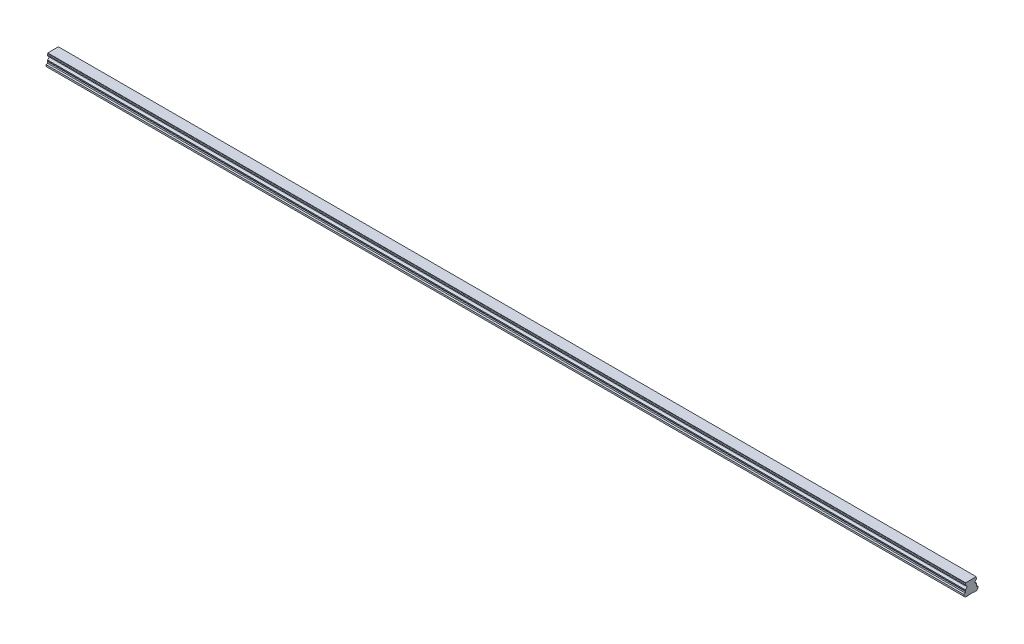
from build123d import *

# Parameters (mm, degrees)
BOSS_EXTRUDE1_DEPTH        = 1620
SKETCH3_R                  = 3
SKETCH3_R_2                = 2.5
CUT_EXTRUDE3_DEPTH         = 12
SKETCH3_2_R                = 2.5
CUT_EXTRUDE4_DEPTH         = 15
CHAMFER1_SIZE              = 0.5
LPATTERN4_COUNT            = 27
LPATTERN4_PITCH            = 60
CHAMFER1_OF_LPATTERN4_SIZE = 0.5


with BuildPart() as part:
    # Sketch1 → Boss-Extrude1 (new body)
    with BuildSketch(Plane(origin=(0, 0, 0), x_dir=(0, 0, -1), z_dir=(1, 0, 0))):
        with BuildLine():
            Line((9.375, 21.8), (-9.375, 21.8))
            Line((-9.375, 21.8), (-9.375, 20.756))
            Line((-9.375, 20.756), (-10, 19.415683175))
            Line((-10, 19.415683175), (-10, 17.685449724))
            ThreePointArc((-10, 17.685449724), (-7.2, 14.6), (-10, 11.514550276))
            Line((-10, 11.514550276), (-10, 9.784316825))
            Line((-10, 9.784316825), (-9.375, 8.444))
            Line((-9.375, 8.444), (-9.922688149, 6.4))
            Line((-9.922688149, 6.4), (-12.5, 5.489338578))
            Line((-12.5, 5.489338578), (-12.5, 2.65))
            Line((-12.5, 2.65), (-9.85, 0))
            Line((-9.85, 0), (-5.5, 0))
            Line((-5.5, 0), (-5, 0.5))
            Line((-5, 0.5), (5, 0.5))
            Line((5, 0.5), (5.5, 0))
            Line((5.5, 0), (9.85, 0))
            Line((9.85, 0), (12.5, 2.65))
            Line((12.5, 2.65), (12.5, 5.489338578))
            Line((12.5, 5.489338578), (9.922688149, 6.4))
            Line((9.922688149, 6.4), (9.375, 8.444))
            Line((9.375, 8.444), (10, 9.784316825))
            Line((10, 9.784316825), (10, 11.514550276))
            ThreePointArc((10, 11.514550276), (7.2, 14.6), (10, 17.685449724))
            Line((10, 17.685449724), (10, 19.415683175))
            Line((10, 19.415683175), (9.375, 20.756))
            Line((9.375, 20.756), (9.375, 21.8))
        make_face()
    extrude(amount=BOSS_EXTRUDE1_DEPTH)

    # Sketch3 → Cut-Extrude3 (cut)
    with BuildSketch(Plane.XZ):
        with Locations(Location((30, 0, 0), (0, 0, 270))):
            Circle(SKETCH3_R)
        with Locations(Location((30, 0, 0), (0, 0, 270))):
            Circle(SKETCH3_R_2, mode=Mode.SUBTRACT)
    cut_extrude3 = extrude(amount=-CUT_EXTRUDE3_DEPTH, mode=Mode.SUBTRACT)

    # Sketch3_2 → Cut-Extrude4 (cut)
    with BuildSketch(Plane.XZ):
        with Locations(Location((30, 0, 0), (0, 0, 270))):
            Circle(SKETCH3_2_R)
    cut_extrude4 = extrude(amount=-CUT_EXTRUDE4_DEPTH, mode=Mode.SUBTRACT)

    # Cut-Extrude5 cone 1 section (on through the dimple's axis) → Cut-Extrude5 (revolve, cut)
    with BuildSketch(Plane(origin=(30, 15, 0), x_dir=(0, 0, -1), z_dir=(1, 0, 0))):
        Polygon((0, 0), (2.5, 0), (0, 1.443375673), align=None)
    cut_extrude5 = revolve(axis=Axis((30, 15, 0), (0, 1, 0)), mode=Mode.SUBTRACT)

    # Chamfer1
    chamfer1_edges = [part.edges().sort_by_distance(p)[0] for p in [
        (30, 0.5, 3),
    ]]
    chamfer(chamfer1_edges, length=CHAMFER1_SIZE)

    # LPattern4: Cut-Extrude3, Cut-Extrude4, Cut-Extrude5 ×27
    with Locations(*[(i * LPATTERN4_PITCH, 0, 0) for i in range(1, LPATTERN4_COUNT)]):
        add(cut_extrude3, mode=Mode.SUBTRACT)
        add(cut_extrude4, mode=Mode.SUBTRACT)
        add(cut_extrude5, mode=Mode.SUBTRACT)

    # Chamfer1 of LPattern4
    chamfer1_of_lpattern4_edges = [part.edges().sort_by_distance(p)[0] for p in [
        (90, 0.5, 3),
        (150, 0.5, 3),
        (210, 0.5, 3),
        (270, 0.5, 3),
        (330, 0.5, 3),
        (390, 0.5, 3),
        (450, 0.5, 3),
        (510, 0.5, 3),
        (570, 0.5, 3),
        (630, 0.5, 3),
        (690, 0.5, 3),
        (750, 0.5, 3),
        (810, 0.5, 3),
        (870, 0.5, 3),
        (930, 0.5, 3),
        (990, 0.5, 3),
        (1050, 0.5, 3),
        (1110, 0.5, 3),
        (1170, 0.5, 3),
        (1230, 0.5, 3),
        (1290, 0.5, 3),
        (1350, 0.5, 3),
        (1410, 0.5, 3),
        (1470, 0.5, 3),
        (1530, 0.5, 3),
        (1590, 0.5, 3),
    ]]
    chamfer(chamfer1_of_lpattern4_edges, length=CHAMFER1_OF_LPATTERN4_SIZE)


solid = part.part
